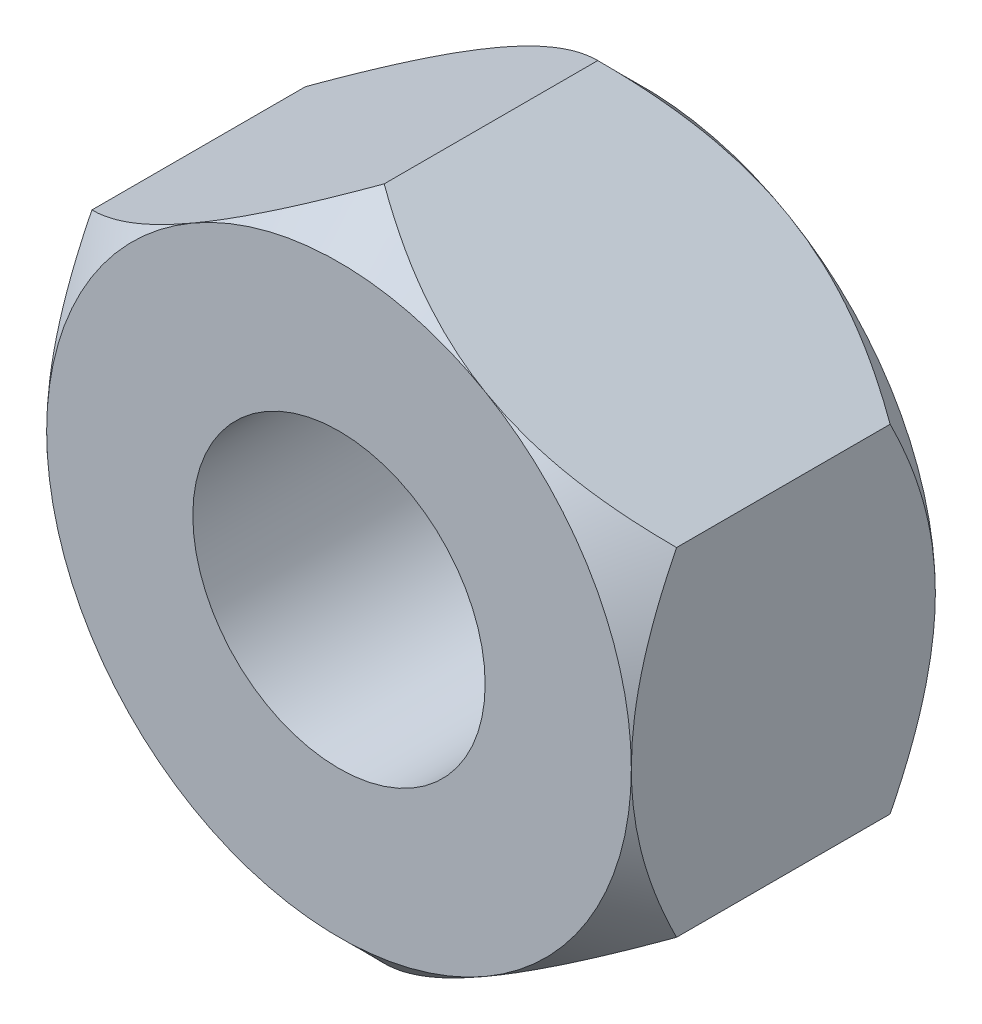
ISO-10303-21;
HEADER;
FILE_DESCRIPTION(('STEP AP214'),'2;1');
FILE_NAME('part.step','',(''),(''),'','','');
FILE_SCHEMA(('AUTOMOTIVE_DESIGN { 1 0 10303 214 1 1 1 1 }'));
ENDSEC;
DATA;
#1=APPLICATION_CONTEXT('core data for automotive mechanical design processes');
#2=APPLICATION_PROTOCOL_DEFINITION('international standard','automotive_design',2000,#1);
#3=PRODUCT_CONTEXT('',#1,'mechanical');
#4=PRODUCT('Part','Part','',(#3));
#5=PRODUCT_RELATED_PRODUCT_CATEGORY('part','',(#4));
#6=PRODUCT_DEFINITION_FORMATION('','',#4);
#7=PRODUCT_DEFINITION_CONTEXT('part definition',#1,'design');
#8=PRODUCT_DEFINITION('design','',#6,#7);
#9=PRODUCT_DEFINITION_SHAPE('','',#8);
#10=(LENGTH_UNIT() NAMED_UNIT(*) SI_UNIT(.MILLI.,.METRE.));
#11=(NAMED_UNIT(*) PLANE_ANGLE_UNIT() SI_UNIT($,.RADIAN.));
#12=(NAMED_UNIT(*) SI_UNIT($,.STERADIAN.) SOLID_ANGLE_UNIT());
#13=UNCERTAINTY_MEASURE_WITH_UNIT(LENGTH_MEASURE(1.E-05),#10,'distance_accuracy_value','');
#14=(GEOMETRIC_REPRESENTATION_CONTEXT(3) GLOBAL_UNCERTAINTY_ASSIGNED_CONTEXT((#13)) GLOBAL_UNIT_ASSIGNED_CONTEXT((#10,
#11,#12)) REPRESENTATION_CONTEXT('',''));
#15=CARTESIAN_POINT('',(0.,0.,0.));
#16=DIRECTION('',(0.,0.,1.));
#17=DIRECTION('',(1.,0.,0.));
#18=AXIS2_PLACEMENT_3D('',#15,#16,#17);
#19=CARTESIAN_POINT('',(0.,5.77350269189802,5.1999999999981));
#20=DIRECTION('',(0.5,-0.866025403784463,0.));
#21=DIRECTION('',(0.86602540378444,0.50000000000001,0.));
#22=AXIS2_PLACEMENT_3D('',#19,#20,#21);
#23=PLANE('',#22);
#24=DIRECTION('',(0.,0.,-1.00000000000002));
#25=VECTOR('',#24,1.);
#26=CARTESIAN_POINT('',(0.,5.77350269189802,5.1999999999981));
#27=LINE('',#26,#25);
#28=CARTESIAN_POINT('',(-2.22044604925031E-13,5.77350269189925,4.4264973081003));
#29=VERTEX_POINT('',#28);
#30=CARTESIAN_POINT('',(3.88578058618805E-13,5.77350269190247,0.773502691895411));
#31=VERTEX_POINT('',#30);
#32=EDGE_CURVE('E248',#29,#31,#27,.T.);
#33=ORIENTED_EDGE('',*,*,#32,.T.);
#34=CARTESIAN_POINT('',(0.000200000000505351,5.77361816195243,0.773618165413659));
#35=CARTESIAN_POINT('',(-0.0857727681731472,5.72398176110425,0.723986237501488));
#36=CARTESIAN_POINT('',(-0.172406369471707,5.6739638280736,0.675877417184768));
#37=CARTESIAN_POINT('',(-0.347124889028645,5.57309004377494,0.583169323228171));
#38=CARTESIAN_POINT('',(-0.435210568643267,5.5222337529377,0.538571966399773));
#39=CARTESIAN_POINT('',(-0.702658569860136,5.36782257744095,0.410361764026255));
#40=CARTESIAN_POINT('',(-0.884284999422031,5.26296050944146,0.332877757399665));
#41=CARTESIAN_POINT('',(-1.25054924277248,5.05149774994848,0.200191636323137));
#42=CARTESIAN_POINT('',(-1.43509343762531,4.94495110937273,0.144655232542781));
#43=CARTESIAN_POINT('',(-1.71494377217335,4.7833794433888,0.080413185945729));
#44=CARTESIAN_POINT('',(-1.80863923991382,4.7292843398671,0.0621848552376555));
#45=CARTESIAN_POINT('',(-1.996823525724,4.620636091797,0.032494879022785));
#46=CARTESIAN_POINT('',(-2.0913122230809,4.56608301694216,0.0210322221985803));
#47=CARTESIAN_POINT('',(-2.32156625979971,4.43314578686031,0.00181355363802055));
#48=CARTESIAN_POINT('',(-2.45757968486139,4.35461839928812,-0.00221901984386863));
#49=CARTESIAN_POINT('',(-2.72936141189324,4.19770514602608,0.00454854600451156));
#50=CARTESIAN_POINT('',(-2.86512961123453,4.11931933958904,0.0153538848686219));
#51=CARTESIAN_POINT('',(-3.13538603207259,3.96328672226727,0.0511603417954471));
#52=CARTESIAN_POINT('',(-3.26987265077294,3.88564083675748,0.0761773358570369));
#53=CARTESIAN_POINT('',(-3.53653439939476,3.73168360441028,0.139047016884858));
#54=CARTESIAN_POINT('',(-3.66870970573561,3.6553721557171,0.176898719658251));
#55=CARTESIAN_POINT('',(-3.90334820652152,3.51990355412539,0.254772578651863));
#56=CARTESIAN_POINT('',(-4.00633089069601,3.46044647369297,0.29274694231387));
#57=CARTESIAN_POINT('',(-4.21044753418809,3.34259967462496,0.374815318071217));
#58=CARTESIAN_POINT('',(-4.31158143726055,3.28420998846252,0.418909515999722));
#59=CARTESIAN_POINT('',(-4.5116819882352,3.1686818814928,0.512229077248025));
#60=CARTESIAN_POINT('',(-4.61065432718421,3.11154017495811,0.561438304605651));
#61=CARTESIAN_POINT('',(-4.80676624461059,2.99831490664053,0.664341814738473));
#62=CARTESIAN_POINT('',(-4.90390690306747,2.94223072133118,0.718033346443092));
#63=CARTESIAN_POINT('',(-5.0001999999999,2.88663587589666,0.77361816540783));
#64=B_SPLINE_CURVE_WITH_KNOTS('',3,(#34,#35,#36,#37,#38,#39,#40,#41,#42,#43,#44,#45,#46,#47,#48,
#49,#50,#51,#52,#53,#54,#55,#56,#57,#58,#59,#60,#61,#62,#63),.UNSPECIFIED.,.F.,.F.,(4,2,2,2,2,2,
2,2,2,2,2,2,2,2,4),(0.,0.332945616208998,0.666071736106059,1.33592065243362,1.99513262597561,
2.32409207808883,2.65300234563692,3.1235896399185,3.59434188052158,4.06562104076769,
4.53686407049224,4.91117956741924,5.28550643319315,5.65868635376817,6.03163889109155),.UNSPECIFIED.);
#65=CARTESIAN_POINT('',(-2.49999999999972,4.33012701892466,-2.38697950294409E-12));
#66=VERTEX_POINT('',#65);
#67=EDGE_CURVE('E49',#31,#66,#64,.T.);
#68=ORIENTED_EDGE('',*,*,#67,.T.);
#69=CARTESIAN_POINT('',(-4.99999999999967,2.88675134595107,0.773502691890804));
#70=VERTEX_POINT('',#69);
#71=EDGE_CURVE('E144',#66,#70,#64,.T.);
#72=ORIENTED_EDGE('',*,*,#71,.T.);
#73=DIRECTION('',(0.,0.,-1.00000000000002));
#74=VECTOR('',#73,1.);
#75=CARTESIAN_POINT('',(-4.99999999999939,2.88675134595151,5.19999999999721));
#76=LINE('',#75,#74);
#77=CARTESIAN_POINT('',(-4.99999999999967,2.88675134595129,4.42649730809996));
#78=VERTEX_POINT('',#77);
#79=EDGE_CURVE('E154',#78,#70,#76,.T.);
#80=ORIENTED_EDGE('',*,*,#79,.F.);
#81=CARTESIAN_POINT('',(0.000200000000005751,5.77361816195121,4.42638183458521));
#82=CARTESIAN_POINT('',(-0.0857727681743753,5.72398176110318,4.47601376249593));
#83=CARTESIAN_POINT('',(-0.172406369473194,5.67396382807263,4.52412258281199));
#84=CARTESIAN_POINT('',(-0.347124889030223,5.57309004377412,4.616830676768));
#85=CARTESIAN_POINT('',(-0.435210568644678,5.52223375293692,4.66142803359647));
#86=CARTESIAN_POINT('',(-0.702658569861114,5.3678225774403,4.78963823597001));
#87=CARTESIAN_POINT('',(-0.884284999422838,5.26296050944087,4.86712224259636));
#88=CARTESIAN_POINT('',(-1.25054924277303,5.05149774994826,4.99980836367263));
#89=CARTESIAN_POINT('',(-1.43509343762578,4.94495110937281,5.05534476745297));
#90=CARTESIAN_POINT('',(-1.71494377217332,4.78337944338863,5.11958681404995));
#91=CARTESIAN_POINT('',(-1.80863923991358,4.72928433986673,5.137815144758));
#92=CARTESIAN_POINT('',(-1.99682352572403,4.62063609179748,5.16750512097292));
#93=CARTESIAN_POINT('',(-2.09131222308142,4.56608301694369,5.1789677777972));
#94=CARTESIAN_POINT('',(-2.32156625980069,4.43314578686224,5.19818644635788));
#95=CARTESIAN_POINT('',(-2.45757968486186,4.35461839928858,5.20221901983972));
#96=CARTESIAN_POINT('',(-2.72936141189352,4.19770514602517,5.19545145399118));
#97=CARTESIAN_POINT('',(-2.86512961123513,4.11931933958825,5.18464611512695));
#98=CARTESIAN_POINT('',(-3.13538603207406,3.96328672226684,5.1488396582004));
#99=CARTESIAN_POINT('',(-3.26987265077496,3.88564083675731,5.12382266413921));
#100=CARTESIAN_POINT('',(-3.53653439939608,3.7316836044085,5.06095298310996));
#101=CARTESIAN_POINT('',(-3.66870970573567,3.65537215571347,5.02310128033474));
#102=CARTESIAN_POINT('',(-3.9033482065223,3.519903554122,4.94522742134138));
#103=CARTESIAN_POINT('',(-4.00633089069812,3.46044647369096,4.90725305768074));
#104=CARTESIAN_POINT('',(-4.21044753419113,3.34259967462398,4.82518468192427));
#105=CARTESIAN_POINT('',(-4.31158143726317,3.28420998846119,4.78109048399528));
#106=CARTESIAN_POINT('',(-4.51168198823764,3.1686818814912,4.68777092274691));
#107=CARTESIAN_POINT('',(-4.61065432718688,3.11154017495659,4.63856169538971));
#108=CARTESIAN_POINT('',(-4.80676624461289,2.99831490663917,4.535658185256));
#109=CARTESIAN_POINT('',(-4.90390690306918,2.94223072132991,4.48196665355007));
#110=CARTESIAN_POINT('',(-5.00019999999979,2.88663587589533,4.42638183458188));
#111=B_SPLINE_CURVE_WITH_KNOTS('',3,(#81,#82,#83,#84,#85,#86,#87,#88,#89,#90,#91,#92,#93,#94,
#95,#96,#97,#98,#99,#100,#101,#102,#103,#104,#105,#106,#107,#108,#109,#110),.UNSPECIFIED.,.F.,
.F.,(4,2,2,2,2,2,2,2,2,2,2,2,2,2,4),(0.,0.332945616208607,0.66607173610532,1.33592065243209,
1.99513262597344,2.32409207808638,2.6530023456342,3.12358963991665,3.59434188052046,
4.06562104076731,4.53686407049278,4.9111795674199,5.28550643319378,5.6586863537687,
6.0316388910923),.UNSPECIFIED.);
#112=CARTESIAN_POINT('',(-2.50000000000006,4.33012701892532,5.19999999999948));
#113=VERTEX_POINT('',#112);
#114=EDGE_CURVE('E228',#113,#78,#111,.T.);
#115=ORIENTED_EDGE('',*,*,#114,.F.);
#116=EDGE_CURVE('E231',#29,#113,#111,.T.);
#117=ORIENTED_EDGE('',*,*,#116,.F.);
#118=EDGE_LOOP('',(#33,#68,#72,#80,#115,#117));
#119=FACE_BOUND('',#118,.T.);
#120=ADVANCED_FACE('F32',(#119),#23,.F.);
#121=CARTESIAN_POINT('',(-4.99999999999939,2.88675134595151,5.19999999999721));
#122=DIRECTION('',(1.00000000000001,0.,0.));
#123=DIRECTION('',(0.,0.,-1.00000000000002));
#124=AXIS2_PLACEMENT_3D('',#121,#122,#123);
#125=PLANE('',#124);
#126=ORIENTED_EDGE('',*,*,#79,.T.);
#127=CARTESIAN_POINT('',(-4.99999999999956,-7.06521360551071,3.65547475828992));
#128=CARTESIAN_POINT('',(-4.99999999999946,-6.88729887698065,3.51028519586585));
#129=CARTESIAN_POINT('',(-4.99999999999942,-6.70851424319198,3.36614463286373));
#130=CARTESIAN_POINT('',(-4.99999999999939,-6.34876707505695,3.08051445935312));
#131=CARTESIAN_POINT('',(-4.9999999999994,-6.16780399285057,2.939025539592));
#132=CARTESIAN_POINT('',(-4.99999999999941,-5.80136121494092,2.65779833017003));
#133=CARTESIAN_POINT('',(-4.9999999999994,-5.61585377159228,2.51809607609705));
#134=CARTESIAN_POINT('',(-4.9999999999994,-5.24174868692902,2.24291781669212));
#135=CARTESIAN_POINT('',(-4.9999999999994,-5.05315134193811,2.10744140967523));
#136=CARTESIAN_POINT('',(-4.9999999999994,-4.6549831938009,1.82983660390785));
#137=CARTESIAN_POINT('',(-4.99999999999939,-4.44505768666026,1.68821406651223));
#138=CARTESIAN_POINT('',(-4.99999999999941,-4.01964625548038,1.41335884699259));
#139=CARTESIAN_POINT('',(-4.99999999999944,-3.80415859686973,1.28012882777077));
#140=CARTESIAN_POINT('',(-4.99999999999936,-3.36748071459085,1.0256588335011));
#141=CARTESIAN_POINT('',(-4.99999999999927,-3.14632123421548,0.904366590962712));
#142=CARTESIAN_POINT('',(-4.99999999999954,-2.69623879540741,0.677321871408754));
#143=CARTESIAN_POINT('',(-4.99999999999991,-2.46732260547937,0.57155625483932));
#144=CARTESIAN_POINT('',(-4.99999999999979,-2.06599661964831,0.407851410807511));
#145=CARTESIAN_POINT('',(-4.9999999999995,-1.89568389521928,0.344808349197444));
#146=CARTESIAN_POINT('',(-4.9999999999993,-1.55051433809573,0.232350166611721));
#147=CARTESIAN_POINT('',(-4.99999999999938,-1.37565688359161,0.182936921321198));
#148=CARTESIAN_POINT('',(-4.99999999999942,-1.02591801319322,0.101398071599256));
#149=CARTESIAN_POINT('',(-4.99999999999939,-0.851120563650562,0.0689183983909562));
#150=CARTESIAN_POINT('',(-4.99999999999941,-0.499119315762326,0.021827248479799));
#151=CARTESIAN_POINT('',(-4.99999999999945,-0.32191607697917,0.00721168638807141));
#152=CARTESIAN_POINT('',(-4.99999999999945,0.0242152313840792,-0.00278521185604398));
#153=CARTESIAN_POINT('',(-4.99999999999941,0.193116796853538,0.000913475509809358));
#154=CARTESIAN_POINT('',(-4.99999999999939,0.529693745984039,0.0251752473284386));
#155=CARTESIAN_POINT('',(-4.99999999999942,0.697369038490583,0.0457395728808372));
#156=CARTESIAN_POINT('',(-4.99999999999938,1.03320275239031,0.102899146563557));
#157=CARTESIAN_POINT('',(-4.99999999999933,1.20130958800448,0.139792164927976));
#158=CARTESIAN_POINT('',(-4.99999999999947,1.53378366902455,0.227499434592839));
#159=CARTESIAN_POINT('',(-4.99999999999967,1.69815101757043,0.278313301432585));
#160=CARTESIAN_POINT('',(-4.99999999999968,2.02819840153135,0.393408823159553));
#161=CARTESIAN_POINT('',(-4.99999999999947,2.19374005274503,0.458082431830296));
#162=CARTESIAN_POINT('',(-4.99999999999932,2.52058608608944,0.597453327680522));
#163=CARTESIAN_POINT('',(-4.99999999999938,2.68188855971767,0.672155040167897));
#164=CARTESIAN_POINT('',(-4.99999999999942,3.00100237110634,0.829812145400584));
#165=CARTESIAN_POINT('',(-4.9999999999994,3.15880122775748,0.912792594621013));
#166=CARTESIAN_POINT('',(-4.99999999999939,3.47079095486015,1.08518608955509));
#167=CARTESIAN_POINT('',(-4.9999999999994,3.62498236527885,1.17459816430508));
#168=CARTESIAN_POINT('',(-4.9999999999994,3.92267514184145,1.35405287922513));
#169=CARTESIAN_POINT('',(-4.9999999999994,4.06632800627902,1.44384553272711));
#170=CARTESIAN_POINT('',(-4.9999999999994,4.35116541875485,1.62727513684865));
#171=CARTESIAN_POINT('',(-4.9999999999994,4.49234978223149,1.72091237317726));
#172=CARTESIAN_POINT('',(-4.99999999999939,4.77144505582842,1.91059137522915));
#173=CARTESIAN_POINT('',(-4.99999999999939,4.90937308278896,2.00660804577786));
#174=CARTESIAN_POINT('',(-4.99999999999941,5.18333377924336,2.20123245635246));
#175=CARTESIAN_POINT('',(-4.99999999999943,5.31936696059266,2.29983947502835));
#176=CARTESIAN_POINT('',(-4.9999999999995,5.45460453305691,2.39950745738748));
#177=B_SPLINE_CURVE_WITH_KNOTS('',3,(#127,#128,#129,#130,#131,#132,#133,#134,#135,#136,#137,
#138,#139,#140,#141,#142,#143,#144,#145,#146,#147,#148,#149,#150,#151,#152,#153,#154,#155,#156,
#157,#158,#159,#160,#161,#162,#163,#164,#165,#166,#167,#168,#169,#170,#171,#172,#173,#174,#175,
#176),.UNSPECIFIED.,.F.,.F.,(4,2,2,2,2,2,2,2,2,2,2,2,2,2,2,2,2,2,2,2,2,2,2,2,4),(0.,
0.688926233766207,1.37802950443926,2.07466442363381,2.77123292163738,3.53077380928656,
4.29055449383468,5.04684495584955,5.80249166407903,6.34685458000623,6.89129237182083,
7.42383690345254,7.95625962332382,8.46221682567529,8.96821126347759,9.48383971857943,
9.99945393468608,10.5322290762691,11.0652401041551,11.5999163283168,12.1345120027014,
12.6426625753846,13.1508509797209,13.6549913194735,14.1589927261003),.UNSPECIFIED.);
#178=CARTESIAN_POINT('',(-4.99999999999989,5.55111512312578E-13,-3.49720252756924E-12));
#179=VERTEX_POINT('',#178);
#180=EDGE_CURVE('E138',#70,#179,#177,.F.);
#181=ORIENTED_EDGE('',*,*,#180,.T.);
#182=CARTESIAN_POINT('',(-4.99999999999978,-2.88675134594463,0.773502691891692));
#183=VERTEX_POINT('',#182);
#184=EDGE_CURVE('E126',#179,#183,#177,.F.);
#185=ORIENTED_EDGE('',*,*,#184,.T.);
#186=DIRECTION('',(0.,0.,-1.00000000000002));
#187=VECTOR('',#186,1.);
#188=CARTESIAN_POINT('',(-4.99999999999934,-2.88675134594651,5.19999999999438));
#189=LINE('',#188,#187);
#190=CARTESIAN_POINT('',(-4.99999999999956,-2.88675134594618,4.42649730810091));
#191=VERTEX_POINT('',#190);
#192=EDGE_CURVE('E256',#191,#183,#189,.T.);
#193=ORIENTED_EDGE('',*,*,#192,.F.);
#194=CARTESIAN_POINT('',(-4.9999999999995,-7.06521360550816,1.54452524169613));
#195=CARTESIAN_POINT('',(-4.99999999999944,-6.8872988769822,1.6897148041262));
#196=CARTESIAN_POINT('',(-4.99999999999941,-6.70851424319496,1.833855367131));
#197=CARTESIAN_POINT('',(-4.99999999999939,-6.34876707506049,2.11948554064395));
#198=CARTESIAN_POINT('',(-4.9999999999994,-6.16780399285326,2.26097446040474));
#199=CARTESIAN_POINT('',(-4.9999999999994,-5.801361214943,2.54220166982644));
#200=CARTESIAN_POINT('',(-4.9999999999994,-5.61585377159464,2.68190392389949));
#201=CARTESIAN_POINT('',(-4.9999999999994,-5.24174868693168,2.95708218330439));
#202=CARTESIAN_POINT('',(-4.9999999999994,-5.0531513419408,3.09255859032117));
#203=CARTESIAN_POINT('',(-4.9999999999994,-4.65498319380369,3.37016339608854));
#204=CARTESIAN_POINT('',(-4.9999999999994,-4.44505768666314,3.51178593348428));
#205=CARTESIAN_POINT('',(-4.9999999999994,-4.01964625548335,3.78664115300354));
#206=CARTESIAN_POINT('',(-4.9999999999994,-3.80415859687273,3.91987117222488));
#207=CARTESIAN_POINT('',(-4.99999999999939,-3.36748071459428,4.1743411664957));
#208=CARTESIAN_POINT('',(-4.99999999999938,-3.14632123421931,4.29563340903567));
#209=CARTESIAN_POINT('',(-4.99999999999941,-2.69623879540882,4.52267812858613));
#210=CARTESIAN_POINT('',(-4.99999999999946,-2.46732260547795,4.62844374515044));
#211=CARTESIAN_POINT('',(-4.99999999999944,-2.06599661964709,4.7921485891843));
#212=CARTESIAN_POINT('',(-4.9999999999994,-1.89568389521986,4.85519165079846));
#213=CARTESIAN_POINT('',(-4.99999999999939,-1.55051433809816,4.96764983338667));
#214=CARTESIAN_POINT('',(-4.99999999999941,-1.37565688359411,5.01706307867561));
#215=CARTESIAN_POINT('',(-4.99999999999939,-1.02591801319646,5.09860192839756));
#216=CARTESIAN_POINT('',(-4.99999999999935,-0.851120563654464,5.13108160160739));
#217=CARTESIAN_POINT('',(-4.99999999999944,-0.49911931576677,5.17817275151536));
#218=CARTESIAN_POINT('',(-4.99999999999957,-0.321916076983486,5.19278831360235));
#219=CARTESIAN_POINT('',(-4.99999999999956,0.0242152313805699,5.20278521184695));
#220=CARTESIAN_POINT('',(-4.99999999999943,0.193116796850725,5.19908652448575));
#221=CARTESIAN_POINT('',(-4.99999999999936,0.52969374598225,5.17482475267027));
#222=CARTESIAN_POINT('',(-4.99999999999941,0.697369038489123,5.15426042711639));
#223=CARTESIAN_POINT('',(-4.99999999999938,1.0332027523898,5.09710085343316));
#224=CARTESIAN_POINT('',(-4.99999999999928,1.2013095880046,5.06020783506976));
#225=CARTESIAN_POINT('',(-4.99999999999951,1.53378366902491,4.9725005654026));
#226=CARTESIAN_POINT('',(-4.99999999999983,1.69815101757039,4.92168669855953));
#227=CARTESIAN_POINT('',(-4.99999999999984,2.02819840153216,4.80659117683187));
#228=CARTESIAN_POINT('',(-4.99999999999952,2.19374005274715,4.741917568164));
#229=CARTESIAN_POINT('',(-4.99999999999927,2.52058608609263,4.6025466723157));
#230=CARTESIAN_POINT('',(-4.99999999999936,2.68188855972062,4.52784495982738));
#231=CARTESIAN_POINT('',(-4.99999999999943,3.00100237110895,4.37018785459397));
#232=CARTESIAN_POINT('',(-4.9999999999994,3.15880122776,4.28720740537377));
#233=CARTESIAN_POINT('',(-4.99999999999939,3.47079095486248,4.11481391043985));
#234=CARTESIAN_POINT('',(-4.99999999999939,3.62498236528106,4.02540183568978));
#235=CARTESIAN_POINT('',(-4.9999999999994,3.92267514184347,3.84594712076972));
#236=CARTESIAN_POINT('',(-4.99999999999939,4.06632800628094,3.75615446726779));
#237=CARTESIAN_POINT('',(-4.9999999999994,4.35116541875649,3.57272486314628));
#238=CARTESIAN_POINT('',(-4.99999999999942,4.49234978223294,3.47908762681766));
#239=CARTESIAN_POINT('',(-4.99999999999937,4.77144505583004,3.28940862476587));
#240=CARTESIAN_POINT('',(-4.99999999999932,4.90937308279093,3.19339195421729));
#241=CARTESIAN_POINT('',(-4.99999999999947,5.18333377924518,2.99876754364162));
#242=CARTESIAN_POINT('',(-4.99999999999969,5.31936696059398,2.90016052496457));
#243=CARTESIAN_POINT('',(-5.00000000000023,5.45460453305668,2.80049254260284));
#244=B_SPLINE_CURVE_WITH_KNOTS('',3,(#194,#195,#196,#197,#198,#199,#200,#201,#202,#203,#204,
#205,#206,#207,#208,#209,#210,#211,#212,#213,#214,#215,#216,#217,#218,#219,#220,#221,#222,#223,
#224,#225,#226,#227,#228,#229,#230,#231,#232,#233,#234,#235,#236,#237,#238,#239,#240,#241,#242,
#243),.UNSPECIFIED.,.F.,.F.,(4,2,2,2,2,2,2,2,2,2,2,2,2,2,2,2,2,2,2,2,2,2,2,2,4),(0.,
0.68892623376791,1.37802950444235,2.07466442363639,2.77123292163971,3.53077380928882,
4.29055449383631,5.04684495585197,5.80249166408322,6.34685458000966,6.8912923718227,
7.42383690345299,7.95625962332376,8.46221682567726,8.96821126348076,9.48383971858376,
9.99945393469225,10.532229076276,11.0652401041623,11.5999163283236,12.134512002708,
12.6426625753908,13.1508509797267,13.6549913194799,14.1589927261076),.UNSPECIFIED.);
#245=CARTESIAN_POINT('',(-5.,4.44089209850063E-13,5.19999999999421));
#246=VERTEX_POINT('',#245);
#247=EDGE_CURVE('E242',#246,#191,#244,.F.);
#248=ORIENTED_EDGE('',*,*,#247,.F.);
#249=EDGE_CURVE('E247',#78,#246,#244,.F.);
#250=ORIENTED_EDGE('',*,*,#249,.F.);
#251=EDGE_LOOP('',(#126,#181,#185,#193,#248,#250));
#252=FACE_BOUND('',#251,.T.);
#253=ADVANCED_FACE('F34',(#252),#125,.F.);
#254=CARTESIAN_POINT('',(-4.99999999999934,-2.88675134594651,5.19999999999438));
#255=DIRECTION('',(0.500000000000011,0.866025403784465,0.));
#256=DIRECTION('',(-0.86602540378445,0.500000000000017,0.));
#257=AXIS2_PLACEMENT_3D('',#254,#255,#256);
#258=PLANE('',#257);
#259=ORIENTED_EDGE('',*,*,#192,.T.);
#260=CARTESIAN_POINT('',(-5.0001999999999,-2.88663587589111,0.773618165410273));
#261=CARTESIAN_POINT('',(-4.91422723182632,-2.93627227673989,0.723986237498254));
#262=CARTESIAN_POINT('',(-4.82759363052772,-2.98629020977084,0.675877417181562));
#263=CARTESIAN_POINT('',(-4.65287511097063,-3.08716399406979,0.583169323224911));
#264=CARTESIAN_POINT('',(-4.56478943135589,-3.13802028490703,0.538571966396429));
#265=CARTESIAN_POINT('',(-4.29734143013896,-3.29243146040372,0.410361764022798));
#266=CARTESIAN_POINT('',(-4.11571500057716,-3.39729352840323,0.332877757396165));
#267=CARTESIAN_POINT('',(-3.74945075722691,-3.6087562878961,0.200191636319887));
#268=CARTESIAN_POINT('',(-3.56490656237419,-3.71530292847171,0.144655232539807));
#269=CARTESIAN_POINT('',(-3.28505622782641,-3.87687459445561,0.0804131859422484));
#270=CARTESIAN_POINT('',(-3.19136076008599,-3.93096969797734,0.0621848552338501));
#271=CARTESIAN_POINT('',(-3.00317647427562,-4.03961794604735,0.0324948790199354));
#272=CARTESIAN_POINT('',(-2.90868777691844,-4.09417102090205,0.021032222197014));
#273=CARTESIAN_POINT('',(-2.67843374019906,-4.22710825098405,0.00181355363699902));
#274=CARTESIAN_POINT('',(-2.54242031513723,-4.30563563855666,-0.00221901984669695));
#275=CARTESIAN_POINT('',(-2.27063858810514,-4.46254889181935,0.00454854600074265));
#276=CARTESIAN_POINT('',(-2.13487038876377,-4.54093469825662,0.0153538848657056));
#277=CARTESIAN_POINT('',(-1.86461396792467,-4.69696731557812,0.0511603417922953));
#278=CARTESIAN_POINT('',(-1.73012734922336,-4.77461320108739,0.0761773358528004));
#279=CARTESIAN_POINT('',(-1.46346560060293,-4.92857043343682,0.139047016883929));
#280=CARTESIAN_POINT('',(-1.33129029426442,-5.00488188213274,0.176898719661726));
#281=CARTESIAN_POINT('',(-1.09665179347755,-5.14035048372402,0.254772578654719));
#282=CARTESIAN_POINT('',(-0.993669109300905,-5.19980756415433,0.292746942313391));
#283=CARTESIAN_POINT('',(-0.789552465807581,-5.31765436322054,0.374815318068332));
#284=CARTESIAN_POINT('',(-0.688418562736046,-5.3760440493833,0.418909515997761));
#285=CARTESIAN_POINT('',(-0.488318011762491,-5.49157215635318,0.512229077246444));
#286=CARTESIAN_POINT('',(-0.389345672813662,-5.54871386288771,0.561438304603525));
#287=CARTESIAN_POINT('',(-0.193233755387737,-5.66193913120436,0.664341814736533));
#288=CARTESIAN_POINT('',(-0.0960930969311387,-5.71802331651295,0.718033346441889));
#289=CARTESIAN_POINT('',(0.000200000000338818,-5.77361816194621,0.773618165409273));
#290=B_SPLINE_CURVE_WITH_KNOTS('',3,(#260,#261,#262,#263,#264,#265,#266,#267,#268,#269,#270,
#271,#272,#273,#274,#275,#276,#277,#278,#279,#280,#281,#282,#283,#284,#285,#286,#287,#288,#289),
.UNSPECIFIED.,.F.,.F.,(4,2,2,2,2,2,2,2,2,2,2,2,2,2,4),(0.,0.332945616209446,0.666071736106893,
1.33592065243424,1.99513262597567,2.32409207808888,2.65300234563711,3.1235896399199,
3.59434188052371,4.06562104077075,4.53686407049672,4.91117956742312,5.28550643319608,
5.65868635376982,6.03163889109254),.UNSPECIFIED.);
#291=CARTESIAN_POINT('',(-2.49999999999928,-4.33012701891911,-3.5527136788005E-12));
#292=VERTEX_POINT('',#291);
#293=EDGE_CURVE('E133',#183,#292,#290,.T.);
#294=ORIENTED_EDGE('',*,*,#293,.T.);
#295=CARTESIAN_POINT('',(3.33066907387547E-13,-5.77350269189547,0.773502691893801));
#296=VERTEX_POINT('',#295);
#297=EDGE_CURVE('E164',#292,#296,#290,.T.);
#298=ORIENTED_EDGE('',*,*,#297,.T.);
#299=DIRECTION('',(0.,0.,-1.00000000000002));
#300=VECTOR('',#299,1.);
#301=CARTESIAN_POINT('',(6.66133814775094E-13,-5.77350269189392,5.19999999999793));
#302=LINE('',#301,#300);
#303=CARTESIAN_POINT('',(5.55111512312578E-13,-5.77350269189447,4.42649730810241));
#304=VERTEX_POINT('',#303);
#305=EDGE_CURVE('E254',#304,#296,#302,.T.);
#306=ORIENTED_EDGE('',*,*,#305,.F.);
#307=CARTESIAN_POINT('',(-5.00019999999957,-2.88663587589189,4.42638183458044));
#308=CARTESIAN_POINT('',(-4.91422723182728,-2.93627227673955,4.47601376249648));
#309=CARTESIAN_POINT('',(-4.82759363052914,-2.98629020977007,4.52412258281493));
#310=CARTESIAN_POINT('',(-4.65287511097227,-3.08716399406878,4.61683067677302));
#311=CARTESIAN_POINT('',(-4.56478943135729,-3.13802028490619,4.66142803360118));
#312=CARTESIAN_POINT('',(-4.29734143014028,-3.29243146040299,4.7896382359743));
#313=CARTESIAN_POINT('',(-4.11571500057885,-3.39729352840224,4.86712224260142));
#314=CARTESIAN_POINT('',(-3.7494507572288,-3.608756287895,4.99980836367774));
#315=CARTESIAN_POINT('',(-3.56490656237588,-3.71530292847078,5.05534476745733));
#316=CARTESIAN_POINT('',(-3.28505622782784,-3.87687459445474,5.11958681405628));
#317=CARTESIAN_POINT('',(-3.19136076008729,-3.9309696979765,5.1378151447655));
#318=CARTESIAN_POINT('',(-3.00317647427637,-4.03961794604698,5.16750512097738));
#319=CARTESIAN_POINT('',(-2.90868777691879,-4.09417102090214,5.17896777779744));
#320=CARTESIAN_POINT('',(-2.67843374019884,-4.22710825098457,5.19818644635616));
#321=CARTESIAN_POINT('',(-2.54242031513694,-4.30563563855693,5.2022190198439));
#322=CARTESIAN_POINT('',(-2.27063858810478,-4.46254889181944,5.19545145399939));
#323=CARTESIAN_POINT('',(-2.1348703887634,-4.54093469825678,5.18464611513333));
#324=CARTESIAN_POINT('',(-1.86461396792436,-4.69696731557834,5.14883965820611));
#325=CARTESIAN_POINT('',(-1.73012734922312,-4.77461320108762,5.12382266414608));
#326=CARTESIAN_POINT('',(-1.46346560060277,-4.9285704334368,5.06095298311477));
#327=CARTESIAN_POINT('',(-1.33129029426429,-5.00488188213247,5.0231012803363));
#328=CARTESIAN_POINT('',(-1.09665179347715,-5.14035048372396,4.94522742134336));
#329=CARTESIAN_POINT('',(-0.993669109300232,-5.19980756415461,4.90725305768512));
#330=CARTESIAN_POINT('',(-0.789552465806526,-5.31765436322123,4.82518468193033));
#331=CARTESIAN_POINT('',(-0.688418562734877,-5.37604404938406,4.78109048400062));
#332=CARTESIAN_POINT('',(-0.488318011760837,-5.49157215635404,4.68777092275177));
#333=CARTESIAN_POINT('',(-0.38934567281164,-5.54871386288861,4.63856169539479));
#334=CARTESIAN_POINT('',(-0.193233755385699,-5.6619391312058,4.53565818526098));
#335=CARTESIAN_POINT('',(-0.0960930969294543,-5.71802331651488,4.48196665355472));
#336=CARTESIAN_POINT('',(0.000200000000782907,-5.7736181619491,4.42638183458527));
#337=B_SPLINE_CURVE_WITH_KNOTS('',3,(#307,#308,#309,#310,#311,#312,#313,#314,#315,#316,#317,
#318,#319,#320,#321,#322,#323,#324,#325,#326,#327,#328,#329,#330,#331,#332,#333,#334,#335,#336),
.UNSPECIFIED.,.F.,.F.,(4,2,2,2,2,2,2,2,2,2,2,2,2,2,4),(0.,0.332945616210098,0.666071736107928,
1.33592065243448,1.99513262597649,2.32409207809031,2.6530023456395,3.12358963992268,
3.59434188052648,4.06562104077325,4.53686407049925,4.91117956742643,5.28550643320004,
5.65868635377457,6.03163889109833),.UNSPECIFIED.);
#338=CARTESIAN_POINT('',(-2.49999999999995,-4.33012701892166,5.19999999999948));
#339=VERTEX_POINT('',#338);
#340=EDGE_CURVE('E236',#339,#304,#337,.T.);
#341=ORIENTED_EDGE('',*,*,#340,.F.);
#342=EDGE_CURVE('E241',#191,#339,#337,.T.);
#343=ORIENTED_EDGE('',*,*,#342,.F.);
#344=EDGE_LOOP('',(#259,#294,#298,#306,#341,#343));
#345=FACE_BOUND('',#344,.T.);
#346=ADVANCED_FACE('F216',(#345),#258,.F.);
#347=CARTESIAN_POINT('',(5.00000000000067,-2.88675134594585,5.20000000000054));
#348=DIRECTION('',(0.5,-0.866025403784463,0.));
#349=DIRECTION('',(0.86602540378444,0.50000000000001,0.));
#350=AXIS2_PLACEMENT_3D('',#347,#348,#349);
#351=PLANE('',#350);
#352=CARTESIAN_POINT('',(5.00020000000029,-2.886635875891,0.773618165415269));
#353=CARTESIAN_POINT('',(4.91422723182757,-2.93627227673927,0.723986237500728));
#354=CARTESIAN_POINT('',(4.82759363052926,-2.98629020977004,0.675877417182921));
#355=CARTESIAN_POINT('',(4.65287511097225,-3.08716399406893,0.583169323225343));
#356=CARTESIAN_POINT('',(4.56478943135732,-3.13802028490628,0.538571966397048));
#357=CARTESIAN_POINT('',(4.29734143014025,-3.29243146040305,0.410361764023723));
#358=CARTESIAN_POINT('',(4.11571500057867,-3.39729352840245,0.332877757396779));
#359=CARTESIAN_POINT('',(3.74945075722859,-3.60875628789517,0.200191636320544));
#360=CARTESIAN_POINT('',(3.56490656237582,-3.71530292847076,0.144655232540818));
#361=CARTESIAN_POINT('',(3.2850562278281,-3.87687459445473,0.0804131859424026));
#362=CARTESIAN_POINT('',(3.19136076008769,-3.93096969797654,0.062184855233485));
#363=CARTESIAN_POINT('',(3.0031764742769,-4.03961794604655,0.032494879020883));
#364=CARTESIAN_POINT('',(2.90868777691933,-4.0941710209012,0.0210322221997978));
#365=CARTESIAN_POINT('',(2.67843374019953,-4.2271082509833,0.00181355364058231));
#366=CARTESIAN_POINT('',(2.54242031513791,-4.30563563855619,-0.00221901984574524));
#367=CARTESIAN_POINT('',(2.27063858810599,-4.46254889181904,0.00454854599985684));
#368=CARTESIAN_POINT('',(2.13487038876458,-4.54093469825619,0.0153538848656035));
#369=CARTESIAN_POINT('',(1.86461396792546,-4.69696731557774,0.0511603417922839));
#370=CARTESIAN_POINT('',(1.73012734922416,-4.7746132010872,0.0761773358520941));
#371=CARTESIAN_POINT('',(1.46346560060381,-4.92857043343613,0.139047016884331));
#372=CARTESIAN_POINT('',(1.33129029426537,-5.00488188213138,0.17689871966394));
#373=CARTESIAN_POINT('',(1.09665179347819,-5.14035048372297,0.25477257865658));
#374=CARTESIAN_POINT('',(0.993669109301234,-5.19980756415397,0.292746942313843));
#375=CARTESIAN_POINT('',(0.789552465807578,-5.31765436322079,0.374815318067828));
#376=CARTESIAN_POINT('',(0.688418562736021,-5.37604404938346,0.418909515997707));
#377=CARTESIAN_POINT('',(0.488318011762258,-5.49157215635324,0.51222907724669));
#378=CARTESIAN_POINT('',(0.389345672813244,-5.54871386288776,0.561438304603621));
#379=CARTESIAN_POINT('',(0.193233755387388,-5.66193913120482,0.664341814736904));
#380=CARTESIAN_POINT('',(0.0960930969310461,-5.71802331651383,0.718033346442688));
#381=CARTESIAN_POINT('',(-0.000199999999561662,-5.77361816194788,0.773618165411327));
#382=B_SPLINE_CURVE_WITH_KNOTS('',3,(#352,#353,#354,#355,#356,#357,#358,#359,#360,#361,#362,
#363,#364,#365,#366,#367,#368,#369,#370,#371,#372,#373,#374,#375,#376,#377,#378,#379,#380,#381),
.UNSPECIFIED.,.F.,.F.,(4,2,2,2,2,2,2,2,2,2,2,2,2,2,4),(0.,0.332945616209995,0.66607173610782,
1.33592065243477,1.99513262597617,2.32409207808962,2.65300234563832,3.12358963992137,
3.59434188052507,4.06562104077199,4.53686407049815,4.91117956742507,5.28550643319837,
5.65868635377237,6.03163889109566),.UNSPECIFIED.);
#383=CARTESIAN_POINT('',(5.00000000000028,-2.88675134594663,0.773502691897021));
#384=VERTEX_POINT('',#383);
#385=CARTESIAN_POINT('',(2.50000000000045,-4.33012701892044,-2.83106871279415E-12));
#386=VERTEX_POINT('',#385);
#387=EDGE_CURVE('E206',#384,#386,#382,.T.);
#388=ORIENTED_EDGE('',*,*,#387,.F.);
#389=DIRECTION('',(0.,0.,-1.00000000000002));
#390=VECTOR('',#389,1.);
#391=CARTESIAN_POINT('',(5.00000000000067,-2.88675134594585,5.20000000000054));
#392=LINE('',#391,#390);
#393=CARTESIAN_POINT('',(5.00000000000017,-2.88675134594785,4.42649730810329));
#394=VERTEX_POINT('',#393);
#395=EDGE_CURVE('E252',#394,#384,#392,.T.);
#396=ORIENTED_EDGE('',*,*,#395,.F.);
#397=CARTESIAN_POINT('',(5.00020000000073,-2.88663587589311,4.42638183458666));
#398=CARTESIAN_POINT('',(4.9142272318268,-2.93627227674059,4.47601376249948));
#399=CARTESIAN_POINT('',(4.82759363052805,-2.98629020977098,4.52412258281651));
#400=CARTESIAN_POINT('',(4.65287511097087,-3.0871639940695,4.61683067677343));
#401=CARTESIAN_POINT('',(4.56478943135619,-3.13802028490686,4.66142803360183));
#402=CARTESIAN_POINT('',(4.29734143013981,-3.29243146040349,4.78963823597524));
#403=CARTESIAN_POINT('',(4.11571500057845,-3.39729352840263,4.86712224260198));
#404=CARTESIAN_POINT('',(3.74945075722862,-3.60875628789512,4.99980836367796));
#405=CARTESIAN_POINT('',(3.56490656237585,-3.71530292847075,5.05534476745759));
#406=CARTESIAN_POINT('',(3.28505622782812,-3.87687459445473,5.11958681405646));
#407=CARTESIAN_POINT('',(3.1913607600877,-3.93096969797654,5.13781514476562));
#408=CARTESIAN_POINT('',(3.00317647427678,-4.03961794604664,5.16750512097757));
#409=CARTESIAN_POINT('',(2.90868777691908,-4.09417102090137,5.17896777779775));
#410=CARTESIAN_POINT('',(2.67843374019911,-4.22710825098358,5.19818644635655));
#411=CARTESIAN_POINT('',(2.54242031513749,-4.30563563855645,5.20221901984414));
#412=CARTESIAN_POINT('',(2.27063858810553,-4.46254889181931,5.19545145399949));
#413=CARTESIAN_POINT('',(2.13487038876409,-4.54093469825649,5.18464611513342));
#414=CARTESIAN_POINT('',(1.864613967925,-4.69696731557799,5.14883965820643));
#415=CARTESIAN_POINT('',(1.73012734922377,-4.77461320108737,5.12382266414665));
#416=CARTESIAN_POINT('',(1.46346560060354,-4.92857043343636,5.0609529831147));
#417=CARTESIAN_POINT('',(1.33129029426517,-5.00488188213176,5.02310128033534));
#418=CARTESIAN_POINT('',(1.09665179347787,-5.14035048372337,4.94522742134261));
#419=CARTESIAN_POINT('',(0.993669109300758,-5.1998075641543,4.90725305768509));
#420=CARTESIAN_POINT('',(0.78955246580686,-5.31765436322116,4.82518468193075));
#421=CARTESIAN_POINT('',(0.688418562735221,-5.37604404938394,4.78109048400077));
#422=CARTESIAN_POINT('',(0.488318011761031,-5.49157215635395,4.68777092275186));
#423=CARTESIAN_POINT('',(0.389345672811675,-5.54871386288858,4.6385616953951));
#424=CARTESIAN_POINT('',(0.193233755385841,-5.66193913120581,4.53565818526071));
#425=CARTESIAN_POINT('',(0.0960930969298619,-5.71802331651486,4.48196665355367));
#426=CARTESIAN_POINT('',(-0.000199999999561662,-5.77361816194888,4.42638183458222));
#427=B_SPLINE_CURVE_WITH_KNOTS('',3,(#397,#398,#399,#400,#401,#402,#403,#404,#405,#406,#407,
#408,#409,#410,#411,#412,#413,#414,#415,#416,#417,#418,#419,#420,#421,#422,#423,#424,#425,#426),
.UNSPECIFIED.,.F.,.F.,(4,2,2,2,2,2,2,2,2,2,2,2,2,2,4),(0.,0.332945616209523,0.666071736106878,
1.33592065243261,1.99513262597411,2.32409207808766,2.65300234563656,3.12358963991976,
3.59434188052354,4.06562104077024,4.53686407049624,4.91117956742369,5.28550643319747,
5.65868635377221,6.03163889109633),.UNSPECIFIED.);
#428=CARTESIAN_POINT('',(2.5000000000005,-4.33012701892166,5.19999999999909));
#429=VERTEX_POINT('',#428);
#430=EDGE_CURVE('E221',#394,#429,#427,.T.);
#431=ORIENTED_EDGE('',*,*,#430,.T.);
#432=EDGE_CURVE('E230',#429,#304,#427,.T.);
#433=ORIENTED_EDGE('',*,*,#432,.T.);
#434=ORIENTED_EDGE('',*,*,#305,.T.);
#435=EDGE_CURVE('E57',#386,#296,#382,.T.);
#436=ORIENTED_EDGE('',*,*,#435,.F.);
#437=EDGE_LOOP('',(#388,#396,#431,#433,#434,#436));
#438=FACE_BOUND('',#437,.T.);
#439=ADVANCED_FACE('F212',(#438),#351,.T.);
#440=CARTESIAN_POINT('',(5.00000000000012,2.88675134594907,5.2000000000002));
#441=DIRECTION('',(1.00000000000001,0.,0.));
#442=DIRECTION('',(0.,0.,-1.00000000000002));
#443=AXIS2_PLACEMENT_3D('',#440,#441,#442);
#444=PLANE('',#443);
#445=CARTESIAN_POINT('',(5.00000000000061,-7.06521360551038,3.65547475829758));
#446=CARTESIAN_POINT('',(5.00000000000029,-6.88729887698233,3.51028519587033));
#447=CARTESIAN_POINT('',(5.00000000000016,-6.70851424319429,3.36614463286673));
#448=CARTESIAN_POINT('',(5.00000000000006,-6.34876707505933,3.08051445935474));
#449=CARTESIAN_POINT('',(5.0000000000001,-6.1678039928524,2.93902553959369));
#450=CARTESIAN_POINT('',(5.00000000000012,-5.80136121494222,2.65779833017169));
#451=CARTESIAN_POINT('',(5.00000000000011,-5.61585377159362,2.51809607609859));
#452=CARTESIAN_POINT('',(5.0000000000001,-5.24174868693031,2.24291781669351));
#453=CARTESIAN_POINT('',(5.00000000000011,-5.05315134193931,2.10744140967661));
#454=CARTESIAN_POINT('',(5.00000000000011,-4.65498319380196,1.82983660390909));
#455=CARTESIAN_POINT('',(5.0000000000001,-4.44505768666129,1.68821406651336));
#456=CARTESIAN_POINT('',(5.00000000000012,-4.01964625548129,1.41335884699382));
#457=CARTESIAN_POINT('',(5.00000000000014,-3.80415859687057,1.28012882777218));
#458=CARTESIAN_POINT('',(5.00000000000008,-3.36748071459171,1.02565883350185));
#459=CARTESIAN_POINT('',(5.,-3.14632123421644,0.904366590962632));
#460=CARTESIAN_POINT('',(5.00000000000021,-2.69623879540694,0.677321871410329));
#461=CARTESIAN_POINT('',(5.0000000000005,-2.46732260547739,0.571556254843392));
#462=CARTESIAN_POINT('',(5.00000000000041,-2.06599661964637,0.407851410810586));
#463=CARTESIAN_POINT('',(5.00000000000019,-1.89568389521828,0.344808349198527));
#464=CARTESIAN_POINT('',(5.00000000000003,-1.55051433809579,0.232350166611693));
#465=CARTESIAN_POINT('',(5.00000000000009,-1.37565688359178,0.182936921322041));
#466=CARTESIAN_POINT('',(5.00000000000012,-1.02591801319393,0.101398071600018));
#467=CARTESIAN_POINT('',(5.0000000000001,-0.851120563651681,0.0689183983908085));
#468=CARTESIAN_POINT('',(5.00000000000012,-0.499119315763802,0.0218272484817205));
#469=CARTESIAN_POINT('',(5.00000000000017,-0.321916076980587,0.00721168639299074));
#470=CARTESIAN_POINT('',(5.00000000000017,0.0242152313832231,-0.00278521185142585));
#471=CARTESIAN_POINT('',(5.00000000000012,0.193116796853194,0.000913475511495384));
#472=CARTESIAN_POINT('',(5.00000000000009,0.529693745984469,0.0251752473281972));
#473=CARTESIAN_POINT('',(5.00000000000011,0.697369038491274,0.0457395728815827));
#474=CARTESIAN_POINT('',(5.00000000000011,1.03320275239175,0.1028991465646));
#475=CARTESIAN_POINT('',(5.00000000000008,1.20130958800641,0.139792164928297));
#476=CARTESIAN_POINT('',(5.00000000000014,1.53378366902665,0.227499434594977));
#477=CARTESIAN_POINT('',(5.00000000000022,1.69815101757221,0.278313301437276));
#478=CARTESIAN_POINT('',(5.00000000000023,2.02819840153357,0.393408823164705));
#479=CARTESIAN_POINT('',(5.00000000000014,2.19374005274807,0.45808243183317));
#480=CARTESIAN_POINT('',(5.00000000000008,2.52058608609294,0.597453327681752));
#481=CARTESIAN_POINT('',(5.0000000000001,2.6818885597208,0.672155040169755));
#482=CARTESIAN_POINT('',(5.00000000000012,3.00100237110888,0.829812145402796));
#483=CARTESIAN_POINT('',(5.00000000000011,3.15880122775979,0.912792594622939));
#484=CARTESIAN_POINT('',(5.00000000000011,3.47079095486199,1.08518608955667));
#485=CARTESIAN_POINT('',(5.00000000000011,3.62498236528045,1.17459816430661));
#486=CARTESIAN_POINT('',(5.00000000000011,3.92267514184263,1.35405287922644));
#487=CARTESIAN_POINT('',(5.00000000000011,4.06632800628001,1.44384553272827));
#488=CARTESIAN_POINT('',(5.00000000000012,4.35116541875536,1.62727513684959));
#489=CARTESIAN_POINT('',(5.00000000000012,4.49234978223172,1.72091237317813));
#490=CARTESIAN_POINT('',(5.0000000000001,4.77144505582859,1.91059137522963));
#491=CARTESIAN_POINT('',(5.00000000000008,4.90937308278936,2.00660804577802));
#492=CARTESIAN_POINT('',(5.00000000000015,5.18333377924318,2.2012324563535));
#493=CARTESIAN_POINT('',(5.00000000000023,5.31936696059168,2.29983947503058));
#494=CARTESIAN_POINT('',(5.00000000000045,5.45460453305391,2.39950745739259));
#495=B_SPLINE_CURVE_WITH_KNOTS('',3,(#445,#446,#447,#448,#449,#450,#451,#452,#453,#454,#455,
#456,#457,#458,#459,#460,#461,#462,#463,#464,#465,#466,#467,#468,#469,#470,#471,#472,#473,#474,
#475,#476,#477,#478,#479,#480,#481,#482,#483,#484,#485,#486,#487,#488,#489,#490,#491,#492,#493,
#494),.UNSPECIFIED.,.F.,.F.,(4,2,2,2,2,2,2,2,2,2,2,2,2,2,2,2,2,2,2,2,2,2,2,2,4),(0.,
0.688926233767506,1.3780295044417,2.07466442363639,2.77123292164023,3.53077380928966,
4.29055449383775,5.04684495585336,5.80249166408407,6.34685458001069,6.89129237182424,
7.42383690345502,7.95625962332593,8.46221682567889,8.96821126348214,9.4838397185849,
9.99945393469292,10.5322290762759,11.0652401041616,11.5999163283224,12.1345120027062,
12.6426625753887,13.1508509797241,13.6549913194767,14.1589927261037),.UNSPECIFIED.);
#496=CARTESIAN_POINT('',(5.00000000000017,2.88675134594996,0.773502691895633));
#497=VERTEX_POINT('',#496);
#498=CARTESIAN_POINT('',(5.00000000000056,2.44249065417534E-12,-3.33066907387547E-13));
#499=VERTEX_POINT('',#498);
#500=EDGE_CURVE('E195',#497,#499,#495,.F.);
#501=ORIENTED_EDGE('',*,*,#500,.F.);
#502=DIRECTION('',(0.,0.,-1.00000000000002));
#503=VECTOR('',#502,1.);
#504=CARTESIAN_POINT('',(5.00000000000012,2.88675134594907,5.2000000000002));
#505=LINE('',#504,#503);
#506=CARTESIAN_POINT('',(5.00000000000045,2.88675134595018,4.42649730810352));
#507=VERTEX_POINT('',#506);
#508=EDGE_CURVE('E250',#507,#497,#505,.T.);
#509=ORIENTED_EDGE('',*,*,#508,.F.);
#510=CARTESIAN_POINT('',(5.00000000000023,-7.06521360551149,1.54452524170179));
#511=CARTESIAN_POINT('',(5.00000000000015,-6.88729887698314,1.68971480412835));
#512=CARTESIAN_POINT('',(5.00000000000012,-6.70851424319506,1.83385536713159));
#513=CARTESIAN_POINT('',(5.0000000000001,-6.34876707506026,2.11948554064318));
#514=CARTESIAN_POINT('',(5.0000000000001,-6.16780399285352,2.26097446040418));
#515=CARTESIAN_POINT('',(5.00000000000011,-5.8013612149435,2.54220166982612));
#516=CARTESIAN_POINT('',(5.00000000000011,-5.61585377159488,2.68190392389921));
#517=CARTESIAN_POINT('',(5.00000000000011,-5.24174868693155,2.95708218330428));
#518=CARTESIAN_POINT('',(5.00000000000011,-5.05315134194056,3.09255859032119));
#519=CARTESIAN_POINT('',(5.00000000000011,-4.6549831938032,3.37016339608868));
#520=CARTESIAN_POINT('',(5.0000000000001,-4.44505768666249,3.51178593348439));
#521=CARTESIAN_POINT('',(5.00000000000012,-4.01964625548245,3.78664115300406));
#522=CARTESIAN_POINT('',(5.00000000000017,-3.80415859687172,3.91987117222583));
#523=CARTESIAN_POINT('',(5.00000000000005,-3.36748071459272,4.17434116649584));
#524=CARTESIAN_POINT('',(4.9999999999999,-3.14632123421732,4.29563340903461));
#525=CARTESIAN_POINT('',(5.00000000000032,-2.69623879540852,4.52267812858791));
#526=CARTESIAN_POINT('',(5.0000000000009,-2.46732260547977,4.62844374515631));
#527=CARTESIAN_POINT('',(5.0000000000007,-2.06599661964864,4.79214858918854));
#528=CARTESIAN_POINT('',(5.00000000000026,-1.89568389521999,4.85519165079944));
#529=CARTESIAN_POINT('',(4.99999999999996,-1.55051433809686,4.9676498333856));
#530=CARTESIAN_POINT('',(5.0000000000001,-1.37565688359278,5.01706307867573));
#531=CARTESIAN_POINT('',(5.00000000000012,-1.0259180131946,5.09860192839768));
#532=CARTESIAN_POINT('',(5.,-0.851120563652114,5.13108160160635));
#533=CARTESIAN_POINT('',(5.00000000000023,-0.499119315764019,5.17817275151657));
#534=CARTESIAN_POINT('',(5.00000000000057,-0.32191607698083,5.19278831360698));
#535=CARTESIAN_POINT('',(5.00000000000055,0.0242152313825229,5.20278521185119));
#536=CARTESIAN_POINT('',(5.00000000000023,0.193116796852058,5.19908652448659));
#537=CARTESIAN_POINT('',(5.,0.529693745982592,5.17482475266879));
#538=CARTESIAN_POINT('',(5.0000000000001,0.697369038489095,5.15426042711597));
#539=CARTESIAN_POINT('',(5.00000000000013,1.03320275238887,5.09710085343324));
#540=CARTESIAN_POINT('',(5.00000000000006,1.20130958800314,5.06020783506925));
#541=CARTESIAN_POINT('',(5.00000000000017,1.53378366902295,4.97250056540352));
#542=CARTESIAN_POINT('',(5.00000000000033,1.69815101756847,4.92168669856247));
#543=CARTESIAN_POINT('',(5.00000000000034,2.02819840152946,4.80659117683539));
#544=CARTESIAN_POINT('',(5.00000000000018,2.19374005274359,4.74191756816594));
#545=CARTESIAN_POINT('',(5.00000000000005,2.52058608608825,4.60254667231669));
#546=CARTESIAN_POINT('',(5.0000000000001,2.68188855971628,4.527844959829));
#547=CARTESIAN_POINT('',(5.00000000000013,3.00100237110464,4.37018785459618));
#548=CARTESIAN_POINT('',(5.00000000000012,3.15880122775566,4.28720740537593));
#549=CARTESIAN_POINT('',(5.00000000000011,3.4707909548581,4.11481391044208));
#550=CARTESIAN_POINT('',(5.00000000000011,3.62498236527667,4.02540183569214));
#551=CARTESIAN_POINT('',(5.00000000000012,3.92267514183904,3.84594712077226));
#552=CARTESIAN_POINT('',(5.00000000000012,4.06632800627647,3.75615446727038));
#553=CARTESIAN_POINT('',(5.00000000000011,4.35116541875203,3.57272486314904));
#554=CARTESIAN_POINT('',(5.00000000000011,4.49234978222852,3.47908762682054));
#555=CARTESIAN_POINT('',(5.00000000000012,4.7714450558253,3.28940862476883));
#556=CARTESIAN_POINT('',(5.00000000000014,4.90937308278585,3.19339195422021));
#557=CARTESIAN_POINT('',(5.00000000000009,5.18333377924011,2.99876754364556));
#558=CARTESIAN_POINT('',(5.00000000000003,5.31936696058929,2.90016052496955));
#559=CARTESIAN_POINT('',(4.99999999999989,5.45460453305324,2.80049254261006));
#560=B_SPLINE_CURVE_WITH_KNOTS('',3,(#510,#511,#512,#513,#514,#515,#516,#517,#518,#519,#520,
#521,#522,#523,#524,#525,#526,#527,#528,#529,#530,#531,#532,#533,#534,#535,#536,#537,#538,#539,
#540,#541,#542,#543,#544,#545,#546,#547,#548,#549,#550,#551,#552,#553,#554,#555,#556,#557,#558,
#559),.UNSPECIFIED.,.F.,.F.,(4,2,2,2,2,2,2,2,2,2,2,2,2,2,2,2,2,2,2,2,2,2,2,2,4),(0.,
0.688926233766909,1.37802950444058,2.0746644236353,2.77123292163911,3.5307738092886,
4.2905544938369,5.0468449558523,5.80249166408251,6.3468545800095,6.89129237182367,
7.42383690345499,7.95625962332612,8.4622168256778,8.96821126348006,9.48383971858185,
9.99945393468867,10.5322290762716,11.0652401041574,11.5999163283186,12.1345120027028,
12.6426625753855,13.1508509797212,13.6549913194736,14.1589927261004),.UNSPECIFIED.);
#561=CARTESIAN_POINT('',(5.00000000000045,4.44089209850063E-13,5.20000000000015));
#562=VERTEX_POINT('',#561);
#563=EDGE_CURVE('E288',#507,#562,#560,.F.);
#564=ORIENTED_EDGE('',*,*,#563,.T.);
#565=EDGE_CURVE('E229',#562,#394,#560,.F.);
#566=ORIENTED_EDGE('',*,*,#565,.T.);
#567=ORIENTED_EDGE('',*,*,#395,.T.);
#568=EDGE_CURVE('E211',#499,#384,#495,.F.);
#569=ORIENTED_EDGE('',*,*,#568,.F.);
#570=EDGE_LOOP('',(#501,#509,#564,#566,#567,#569));
#571=FACE_BOUND('',#570,.T.);
#572=ADVANCED_FACE('F215',(#571),#444,.T.);
#573=CARTESIAN_POINT('',(0.,5.77350269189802,5.1999999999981));
#574=DIRECTION('',(0.500000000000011,0.866025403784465,0.));
#575=DIRECTION('',(-0.86602540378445,0.500000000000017,0.));
#576=AXIS2_PLACEMENT_3D('',#573,#574,#575);
#577=PLANE('',#576);
#578=CARTESIAN_POINT('',(-0.00019999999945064,5.77361816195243,0.773618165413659));
#579=CARTESIAN_POINT('',(0.0857727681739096,5.72398176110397,0.723986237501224));
#580=CARTESIAN_POINT('',(0.172406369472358,5.6739638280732,0.675877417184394));
#581=CARTESIAN_POINT('',(0.347124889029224,5.57309004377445,0.583169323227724));
#582=CARTESIAN_POINT('',(0.435210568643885,5.52223375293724,0.538571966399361));
#583=CARTESIAN_POINT('',(0.702658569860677,5.36782257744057,0.410361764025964));
#584=CARTESIAN_POINT('',(0.88428499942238,5.26296050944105,0.332877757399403));
#585=CARTESIAN_POINT('',(1.25054924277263,5.05149774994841,0.200191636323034));
#586=CARTESIAN_POINT('',(1.43509343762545,4.94495110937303,0.144655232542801));
#587=CARTESIAN_POINT('',(1.71494377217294,4.78337944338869,0.0804131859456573));
#588=CARTESIAN_POINT('',(1.80863923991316,4.72928433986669,0.0621848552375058));
#589=CARTESIAN_POINT('',(1.99682352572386,4.62063609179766,0.0324948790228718));
#590=CARTESIAN_POINT('',(2.09131222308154,4.56608301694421,0.0210322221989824));
#591=CARTESIAN_POINT('',(2.321566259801,4.43314578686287,0.00181355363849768));
#592=CARTESIAN_POINT('',(2.45757968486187,4.35461839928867,-0.00221901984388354));
#593=CARTESIAN_POINT('',(2.72936141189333,4.19770514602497,0.00454854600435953));
#594=CARTESIAN_POINT('',(2.86512961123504,4.11931933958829,0.0153538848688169));
#595=CARTESIAN_POINT('',(3.13538603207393,3.96328672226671,0.0511603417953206));
#596=CARTESIAN_POINT('',(3.26987265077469,3.88564083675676,0.0761773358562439));
#597=CARTESIAN_POINT('',(3.53653439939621,3.73168360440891,0.139047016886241));
#598=CARTESIAN_POINT('',(3.66870970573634,3.65537215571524,0.176898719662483));
#599=CARTESIAN_POINT('',(3.90334820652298,3.51990355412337,0.254772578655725));
#600=CARTESIAN_POINT('',(4.00633089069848,3.46044647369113,0.29274694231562));
#601=CARTESIAN_POINT('',(4.2104475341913,3.34259967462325,0.374815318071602));
#602=CARTESIAN_POINT('',(4.31158143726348,3.28420998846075,0.41890951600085));
#603=CARTESIAN_POINT('',(4.51168198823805,3.16868188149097,0.512229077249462));
#604=CARTESIAN_POINT('',(4.61065432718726,3.11154017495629,0.561438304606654));
#605=CARTESIAN_POINT('',(4.80676624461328,2.99831490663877,0.664341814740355));
#606=CARTESIAN_POINT('',(4.9039069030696,2.94223072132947,0.718033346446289));
#607=CARTESIAN_POINT('',(5.00020000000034,2.8866358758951,0.773618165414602));
#608=B_SPLINE_CURVE_WITH_KNOTS('',3,(#578,#579,#580,#581,#582,#583,#584,#585,#586,#587,#588,
#589,#590,#591,#592,#593,#594,#595,#596,#597,#598,#599,#600,#601,#602,#603,#604,#605,#606,#607),
.UNSPECIFIED.,.F.,.F.,(4,2,2,2,2,2,2,2,2,2,2,2,2,2,4),(0.,0.332945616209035,0.666071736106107,
1.33592065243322,1.99513262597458,2.32409207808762,2.65300234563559,3.12358963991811,
3.59434188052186,4.06562104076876,4.5368640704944,4.91117956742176,5.2855064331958,
5.65868635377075,6.0316388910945),.UNSPECIFIED.);
#609=CARTESIAN_POINT('',(2.50000000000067,4.3301270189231,-1.66533453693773E-12));
#610=VERTEX_POINT('',#609);
#611=EDGE_CURVE('E336',#31,#610,#608,.T.);
#612=ORIENTED_EDGE('',*,*,#611,.F.);
#613=ORIENTED_EDGE('',*,*,#32,.F.);
#614=CARTESIAN_POINT('',(-0.000200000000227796,5.77361816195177,4.42638183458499));
#615=CARTESIAN_POINT('',(0.0857727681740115,5.7239817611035,4.47601376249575));
#616=CARTESIAN_POINT('',(0.172406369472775,5.67396382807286,4.52412258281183));
#617=CARTESIAN_POINT('',(0.347124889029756,5.57309004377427,4.61683067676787));
#618=CARTESIAN_POINT('',(0.435210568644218,5.5222337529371,4.66142803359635));
#619=CARTESIAN_POINT('',(0.702658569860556,5.36782257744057,4.7896382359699));
#620=CARTESIAN_POINT('',(0.884284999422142,5.26296050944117,4.86712224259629));
#621=CARTESIAN_POINT('',(1.25054924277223,5.05149774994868,4.99980836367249));
#622=CARTESIAN_POINT('',(1.43509343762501,4.94495110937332,5.0553447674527));
#623=CARTESIAN_POINT('',(1.7149437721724,4.783379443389,5.11958681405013));
#624=CARTESIAN_POINT('',(1.80863923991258,4.72928433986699,5.13781514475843));
#625=CARTESIAN_POINT('',(1.99682352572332,4.62063609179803,5.16750512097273));
#626=CARTESIAN_POINT('',(2.09131222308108,4.56608301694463,5.17896777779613));
#627=CARTESIAN_POINT('',(2.32156625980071,4.43314578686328,5.19818644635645));
#628=CARTESIAN_POINT('',(2.45757968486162,4.35461839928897,5.20221901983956));
#629=CARTESIAN_POINT('',(2.7293614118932,4.19770514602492,5.19545145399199));
#630=CARTESIAN_POINT('',(2.86512961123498,4.11931933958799,5.18464611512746));
#631=CARTESIAN_POINT('',(3.13538603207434,3.96328672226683,5.14883965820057));
#632=CARTESIAN_POINT('',(3.26987265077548,3.88564083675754,5.12382266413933));
#633=CARTESIAN_POINT('',(3.53653439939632,3.73168360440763,5.06095298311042));
#634=CARTESIAN_POINT('',(3.66870970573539,3.65537215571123,5.02310128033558));
#635=CARTESIAN_POINT('',(3.90334820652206,3.51990355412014,4.94522742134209));
#636=CARTESIAN_POINT('',(4.00633089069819,3.46044647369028,4.90725305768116));
#637=CARTESIAN_POINT('',(4.21044753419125,3.34259967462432,4.82518468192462));
#638=CARTESIAN_POINT('',(4.31158143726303,3.28420998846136,4.78109048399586));
#639=CARTESIAN_POINT('',(4.51168198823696,3.16868188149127,4.68777092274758));
#640=CARTESIAN_POINT('',(4.61065432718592,3.11154017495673,4.63856169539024));
#641=CARTESIAN_POINT('',(4.8067662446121,2.9983149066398,4.53565818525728));
#642=CARTESIAN_POINT('',(4.90390690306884,2.94223072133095,4.48196665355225));
#643=CARTESIAN_POINT('',(5.00020000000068,2.88663587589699,4.42638183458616));
#644=B_SPLINE_CURVE_WITH_KNOTS('',3,(#614,#615,#616,#617,#618,#619,#620,#621,#622,#623,#624,
#625,#626,#627,#628,#629,#630,#631,#632,#633,#634,#635,#636,#637,#638,#639,#640,#641,#642,#643),
.UNSPECIFIED.,.F.,.F.,(4,2,2,2,2,2,2,2,2,2,2,2,2,2,4),(0.,0.332945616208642,0.666071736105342,
1.33592065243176,1.99513262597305,2.32409207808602,2.65300234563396,3.12358963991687,
3.59434188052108,4.06562104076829,4.53686407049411,4.91117956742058,5.28550643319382,
5.65868635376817,6.0316388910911),.UNSPECIFIED.);
#645=CARTESIAN_POINT('',(2.49999999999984,4.33012701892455,5.19999999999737));
#646=VERTEX_POINT('',#645);
#647=EDGE_CURVE('E292',#29,#646,#644,.T.);
#648=ORIENTED_EDGE('',*,*,#647,.T.);
#649=EDGE_CURVE('E157',#646,#507,#644,.T.);
#650=ORIENTED_EDGE('',*,*,#649,.T.);
#651=ORIENTED_EDGE('',*,*,#508,.T.);
#652=EDGE_CURVE('E186',#610,#497,#608,.T.);
#653=ORIENTED_EDGE('',*,*,#652,.F.);
#654=EDGE_LOOP('',(#612,#613,#648,#650,#651,#653));
#655=FACE_BOUND('',#654,.T.);
#656=ADVANCED_FACE('F303',(#655),#577,.T.);
#657=CARTESIAN_POINT('',(2.22044604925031E-13,-1.66533453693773E-12,5.19999999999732));
#658=DIRECTION('',(0.,0.,-1.00000000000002));
#659=DIRECTION('',(1.00000000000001,0.,0.));
#660=AXIS2_PLACEMENT_3D('',#657,#658,#659);
#661=CONICAL_SURFACE('',#660,5.,0.78539816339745);
#662=ORIENTED_EDGE('',*,*,#430,.F.);
#663=ORIENTED_EDGE('',*,*,#565,.F.);
#664=CARTESIAN_POINT('',(2.22044604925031E-13,-1.66533453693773E-12,5.19999999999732));
#665=DIRECTION('',(0.,0.,1.00000000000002));
#666=DIRECTION('',(1.00000000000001,0.,0.));
#667=AXIS2_PLACEMENT_3D('',#664,#665,#666);
#668=CIRCLE('',#667,5.);
#669=EDGE_CURVE('E258',#429,#562,#668,.T.);
#670=ORIENTED_EDGE('',*,*,#669,.F.);
#671=EDGE_LOOP('',(#662,#663,#670));
#672=FACE_BOUND('',#671,.T.);
#673=ADVANCED_FACE('F306',(#672),#661,.T.);
#674=EDGE_CURVE('E260',#339,#429,#668,.T.);
#675=ORIENTED_EDGE('',*,*,#674,.F.);
#676=ORIENTED_EDGE('',*,*,#340,.T.);
#677=ORIENTED_EDGE('',*,*,#432,.F.);
#678=EDGE_LOOP('',(#675,#676,#677));
#679=FACE_BOUND('',#678,.T.);
#680=ADVANCED_FACE('F285',(#679),#661,.T.);
#681=EDGE_CURVE('E266',#246,#339,#668,.T.);
#682=ORIENTED_EDGE('',*,*,#681,.F.);
#683=ORIENTED_EDGE('',*,*,#247,.T.);
#684=ORIENTED_EDGE('',*,*,#342,.T.);
#685=EDGE_LOOP('',(#682,#683,#684));
#686=FACE_BOUND('',#685,.T.);
#687=ADVANCED_FACE('F349',(#686),#661,.T.);
#688=ORIENTED_EDGE('',*,*,#114,.T.);
#689=ORIENTED_EDGE('',*,*,#249,.T.);
#690=EDGE_CURVE('E268',#113,#246,#668,.T.);
#691=ORIENTED_EDGE('',*,*,#690,.F.);
#692=EDGE_LOOP('',(#688,#689,#691));
#693=FACE_BOUND('',#692,.T.);
#694=ADVANCED_FACE('F352',(#693),#661,.T.);
#695=ORIENTED_EDGE('',*,*,#647,.F.);
#696=ORIENTED_EDGE('',*,*,#116,.T.);
#697=EDGE_CURVE('E261',#646,#113,#668,.T.);
#698=ORIENTED_EDGE('',*,*,#697,.F.);
#699=EDGE_LOOP('',(#695,#696,#698));
#700=FACE_BOUND('',#699,.T.);
#701=ADVANCED_FACE('F345',(#700),#661,.T.);
#702=ORIENTED_EDGE('',*,*,#563,.F.);
#703=ORIENTED_EDGE('',*,*,#649,.F.);
#704=CARTESIAN_POINT('',(2.22044604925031E-13,-1.66533453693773E-12,5.19999999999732));
#705=DIRECTION('',(0.,0.,1.00000000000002));
#706=DIRECTION('',(1.00000000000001,0.,0.));
#707=AXIS2_PLACEMENT_3D('',#704,#705,#706);
#708=CIRCLE('',#707,5.);
#709=EDGE_CURVE('E155',#562,#646,#708,.T.);
#710=ORIENTED_EDGE('',*,*,#709,.F.);
#711=EDGE_LOOP('',(#702,#703,#710));
#712=FACE_BOUND('',#711,.T.);
#713=ADVANCED_FACE('F180',(#712),#661,.T.);
#714=CARTESIAN_POINT('',(-9.99999999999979,-2.44249065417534E-12,5.19999999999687));
#715=DIRECTION('',(0.,0.,1.00000000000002));
#716=DIRECTION('',(1.00000000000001,0.,0.));
#717=AXIS2_PLACEMENT_3D('',#714,#715,#716);
#718=PLANE('',#717);
#719=CARTESIAN_POINT('',(2.22044604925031E-13,-1.66533453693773E-12,5.19999999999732));
#720=DIRECTION('',(0.,0.,-1.00000000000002));
#721=DIRECTION('',(-1.00000000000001,0.,0.));
#722=AXIS2_PLACEMENT_3D('',#719,#720,#721);
#723=CIRCLE('',#722,2.5);
#724=CARTESIAN_POINT('',(-2.4999999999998,-1.66387736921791E-12,5.19999999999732));
#725=VERTEX_POINT('',#724);
#726=EDGE_CURVE('E328',#725,#725,#723,.T.);
#727=ORIENTED_EDGE('',*,*,#726,.T.);
#728=EDGE_LOOP('',(#727));
#729=FACE_BOUND('',#728,.T.);
#730=ORIENTED_EDGE('',*,*,#669,.T.);
#731=ORIENTED_EDGE('',*,*,#709,.T.);
#732=ORIENTED_EDGE('',*,*,#697,.T.);
#733=ORIENTED_EDGE('',*,*,#690,.T.);
#734=ORIENTED_EDGE('',*,*,#681,.T.);
#735=ORIENTED_EDGE('',*,*,#674,.T.);
#736=EDGE_LOOP('',(#730,#731,#732,#733,#734,#735));
#737=FACE_BOUND('',#736,.T.);
#738=ADVANCED_FACE('F176',(#729,#737),#718,.T.);
#739=CARTESIAN_POINT('',(0.,0.,0.));
#740=DIRECTION('',(0.,0.,1.00000000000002));
#741=DIRECTION('',(1.00000000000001,0.,0.));
#742=AXIS2_PLACEMENT_3D('',#739,#740,#741);
#743=CONICAL_SURFACE('',#742,5.,0.78539816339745);
#744=ORIENTED_EDGE('',*,*,#652,.T.);
#745=ORIENTED_EDGE('',*,*,#500,.T.);
#746=CARTESIAN_POINT('',(0.,0.,0.));
#747=DIRECTION('',(0.,0.,1.00000000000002));
#748=DIRECTION('',(1.00000000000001,0.,0.));
#749=AXIS2_PLACEMENT_3D('',#746,#747,#748);
#750=CIRCLE('',#749,5.);
#751=EDGE_CURVE('E331',#499,#610,#750,.T.);
#752=ORIENTED_EDGE('',*,*,#751,.T.);
#753=EDGE_LOOP('',(#744,#745,#752));
#754=FACE_BOUND('',#753,.T.);
#755=ADVANCED_FACE('F170',(#754),#743,.T.);
#756=ORIENTED_EDGE('',*,*,#67,.F.);
#757=ORIENTED_EDGE('',*,*,#611,.T.);
#758=CARTESIAN_POINT('',(0.,0.,0.));
#759=DIRECTION('',(0.,0.,1.00000000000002));
#760=DIRECTION('',(1.00000000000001,0.,0.));
#761=AXIS2_PLACEMENT_3D('',#758,#759,#760);
#762=CIRCLE('',#761,5.);
#763=EDGE_CURVE('E42',#66,#610,#762,.F.);
#764=ORIENTED_EDGE('',*,*,#763,.F.);
#765=EDGE_LOOP('',(#756,#757,#764));
#766=FACE_BOUND('',#765,.T.);
#767=ADVANCED_FACE('F175',(#766),#743,.T.);
#768=ORIENTED_EDGE('',*,*,#180,.F.);
#769=ORIENTED_EDGE('',*,*,#71,.F.);
#770=EDGE_CURVE('E142',#179,#66,#762,.F.);
#771=ORIENTED_EDGE('',*,*,#770,.F.);
#772=EDGE_LOOP('',(#768,#769,#771));
#773=FACE_BOUND('',#772,.T.);
#774=ADVANCED_FACE('F143',(#773),#743,.T.);
#775=ORIENTED_EDGE('',*,*,#184,.F.);
#776=EDGE_CURVE('E130',#292,#179,#762,.F.);
#777=ORIENTED_EDGE('',*,*,#776,.F.);
#778=ORIENTED_EDGE('',*,*,#293,.F.);
#779=EDGE_LOOP('',(#775,#777,#778));
#780=FACE_BOUND('',#779,.T.);
#781=ADVANCED_FACE('F128',(#780),#743,.T.);
#782=ORIENTED_EDGE('',*,*,#297,.F.);
#783=EDGE_CURVE('E41',#386,#292,#762,.F.);
#784=ORIENTED_EDGE('',*,*,#783,.F.);
#785=ORIENTED_EDGE('',*,*,#435,.T.);
#786=EDGE_LOOP('',(#782,#784,#785));
#787=FACE_BOUND('',#786,.T.);
#788=ADVANCED_FACE('F322',(#787),#743,.T.);
#789=ORIENTED_EDGE('',*,*,#568,.T.);
#790=ORIENTED_EDGE('',*,*,#387,.T.);
#791=EDGE_CURVE('E11',#499,#386,#762,.F.);
#792=ORIENTED_EDGE('',*,*,#791,.F.);
#793=EDGE_LOOP('',(#789,#790,#792));
#794=FACE_BOUND('',#793,.T.);
#795=ADVANCED_FACE('F178',(#794),#743,.T.);
#796=CARTESIAN_POINT('',(-9.99999999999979,1.55431223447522E-12,-5.55111512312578E-12));
#797=DIRECTION('',(0.,0.,1.00000000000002));
#798=DIRECTION('',(1.00000000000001,0.,0.));
#799=AXIS2_PLACEMENT_3D('',#796,#797,#798);
#800=PLANE('',#799);
#801=CARTESIAN_POINT('',(0.,0.,0.));
#802=DIRECTION('',(0.,0.,-1.00000000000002));
#803=DIRECTION('',(-1.00000000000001,0.,0.));
#804=AXIS2_PLACEMENT_3D('',#801,#802,#803);
#805=CIRCLE('',#804,2.5);
#806=CARTESIAN_POINT('',(-2.50000000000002,0.,0.));
#807=VERTEX_POINT('',#806);
#808=EDGE_CURVE('E326',#807,#807,#805,.T.);
#809=ORIENTED_EDGE('',*,*,#808,.F.);
#810=EDGE_LOOP('',(#809));
#811=FACE_BOUND('',#810,.T.);
#812=ORIENTED_EDGE('',*,*,#751,.F.);
#813=ORIENTED_EDGE('',*,*,#791,.T.);
#814=ORIENTED_EDGE('',*,*,#783,.T.);
#815=ORIENTED_EDGE('',*,*,#776,.T.);
#816=ORIENTED_EDGE('',*,*,#770,.T.);
#817=ORIENTED_EDGE('',*,*,#763,.T.);
#818=EDGE_LOOP('',(#812,#813,#814,#815,#816,#817));
#819=FACE_BOUND('',#818,.T.);
#820=ADVANCED_FACE('F149',(#811,#819),#800,.F.);
#821=CARTESIAN_POINT('',(2.22044604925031E-13,-1.66533453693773E-12,5.19999999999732));
#822=DIRECTION('',(0.,0.,-1.00000000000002));
#823=DIRECTION('',(-1.00000000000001,0.,0.));
#824=AXIS2_PLACEMENT_3D('',#821,#822,#823);
#825=CYLINDRICAL_SURFACE('',#824,2.5);
#826=ORIENTED_EDGE('',*,*,#726,.F.);
#827=EDGE_LOOP('',(#826));
#828=FACE_BOUND('',#827,.T.);
#829=ORIENTED_EDGE('',*,*,#808,.T.);
#830=EDGE_LOOP('',(#829));
#831=FACE_BOUND('',#830,.T.);
#832=ADVANCED_FACE('F179',(#828,#831),#825,.F.);
#833=CLOSED_SHELL('',(#120,#253,#346,#439,#572,#656,#673,#680,#687,#694,#701,#713,#738,#755,
#767,#774,#781,#788,#795,#820,#832));
#834=MANIFOLD_SOLID_BREP('B2',#833);
#835=ADVANCED_BREP_SHAPE_REPRESENTATION('',(#18,#834),#14);
#836=SHAPE_DEFINITION_REPRESENTATION(#9,#835);
ENDSEC;
END-ISO-10303-21;
